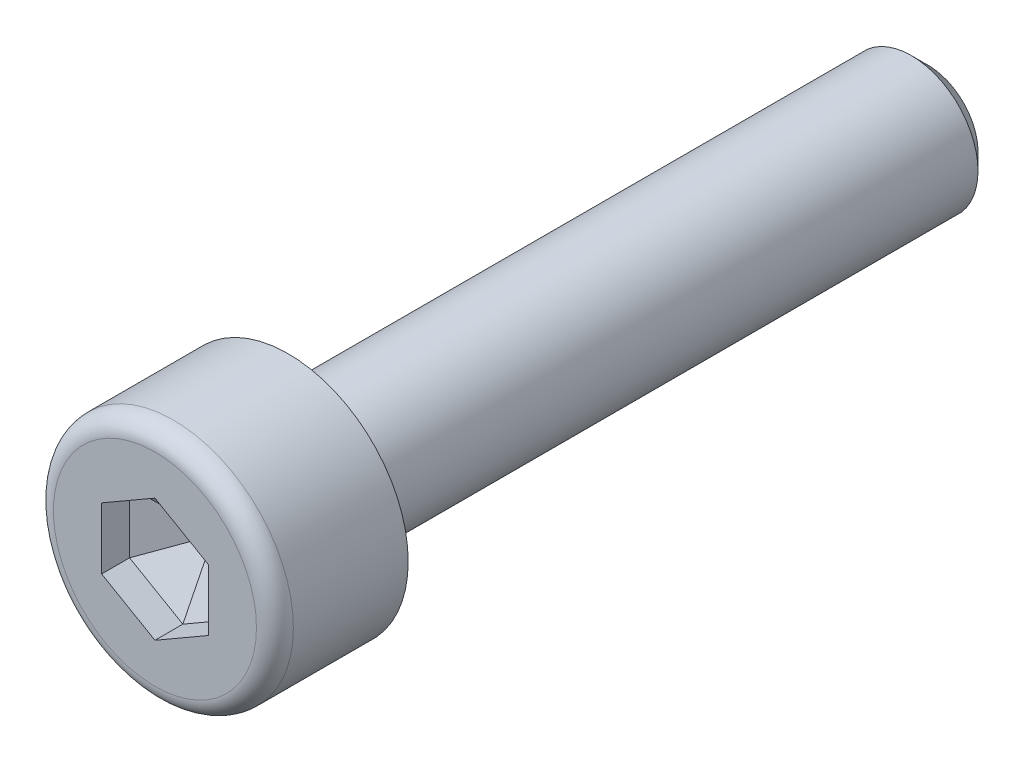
ISO-10303-21;
HEADER;
FILE_DESCRIPTION(('STEP AP214'),'2;1');
FILE_NAME('part.step','',(''),(''),'','','');
FILE_SCHEMA(('AUTOMOTIVE_DESIGN { 1 0 10303 214 1 1 1 1 }'));
ENDSEC;
DATA;
#1=APPLICATION_CONTEXT('core data for automotive mechanical design processes');
#2=APPLICATION_PROTOCOL_DEFINITION('international standard','automotive_design',2000,#1);
#3=PRODUCT_CONTEXT('',#1,'mechanical');
#4=PRODUCT('Part','Part','',(#3));
#5=PRODUCT_RELATED_PRODUCT_CATEGORY('part','',(#4));
#6=PRODUCT_DEFINITION_FORMATION('','',#4);
#7=PRODUCT_DEFINITION_CONTEXT('part definition',#1,'design');
#8=PRODUCT_DEFINITION('design','',#6,#7);
#9=PRODUCT_DEFINITION_SHAPE('','',#8);
#10=(LENGTH_UNIT() NAMED_UNIT(*) SI_UNIT(.MILLI.,.METRE.));
#11=(NAMED_UNIT(*) PLANE_ANGLE_UNIT() SI_UNIT($,.RADIAN.));
#12=(NAMED_UNIT(*) SI_UNIT($,.STERADIAN.) SOLID_ANGLE_UNIT());
#13=UNCERTAINTY_MEASURE_WITH_UNIT(LENGTH_MEASURE(1.E-05),#10,'distance_accuracy_value','');
#14=(GEOMETRIC_REPRESENTATION_CONTEXT(3) GLOBAL_UNCERTAINTY_ASSIGNED_CONTEXT((#13)) GLOBAL_UNIT_ASSIGNED_CONTEXT((#10,
#11,#12)) REPRESENTATION_CONTEXT('',''));
#15=CARTESIAN_POINT('',(0.,0.,0.));
#16=DIRECTION('',(0.,0.,1.));
#17=DIRECTION('',(1.,0.,0.));
#18=AXIS2_PLACEMENT_3D('',#15,#16,#17);
#19=CARTESIAN_POINT('',(0.,0.,0.));
#20=DIRECTION('',(0.,0.,1.));
#21=DIRECTION('',(1.,0.,0.));
#22=AXIS2_PLACEMENT_3D('',#19,#20,#21);
#23=PLANE('',#22);
#24=CARTESIAN_POINT('',(0.,0.,0.));
#25=DIRECTION('',(0.,0.,1.));
#26=DIRECTION('',(1.,0.,0.));
#27=AXIS2_PLACEMENT_3D('',#24,#25,#26);
#28=CIRCLE('',#27,1.35);
#29=CARTESIAN_POINT('',(1.35,0.,0.));
#30=VERTEX_POINT('',#29);
#31=EDGE_CURVE('E11',#30,#30,#28,.T.);
#32=ORIENTED_EDGE('',*,*,#31,.T.);
#33=EDGE_LOOP('',(#32));
#34=FACE_BOUND('',#33,.T.);
#35=CARTESIAN_POINT('',(0.,0.,0.));
#36=DIRECTION('',(0.,0.,1.));
#37=DIRECTION('',(1.,0.,0.));
#38=AXIS2_PLACEMENT_3D('',#35,#36,#37);
#39=CIRCLE('',#38,2.25);
#40=CARTESIAN_POINT('',(2.25,0.,0.));
#41=VERTEX_POINT('',#40);
#42=EDGE_CURVE('E160',#41,#41,#39,.T.);
#43=ORIENTED_EDGE('',*,*,#42,.F.);
#44=EDGE_LOOP('',(#43));
#45=FACE_BOUND('',#44,.T.);
#46=ADVANCED_FACE('F50',(#34,#45),#23,.F.);
#47=CARTESIAN_POINT('',(0.,0.,2.5));
#48=DIRECTION('',(0.,0.,-1.));
#49=DIRECTION('',(-1.,0.,0.));
#50=AXIS2_PLACEMENT_3D('',#47,#48,#49);
#51=CYLINDRICAL_SURFACE('',#50,2.25);
#52=CARTESIAN_POINT('',(0.,0.,2.15384615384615));
#53=DIRECTION('',(0.,0.,1.));
#54=DIRECTION('',(1.,0.,0.));
#55=AXIS2_PLACEMENT_3D('',#52,#53,#54);
#56=CIRCLE('',#55,2.25);
#57=CARTESIAN_POINT('',(2.25,0.,2.15384615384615));
#58=VERTEX_POINT('',#57);
#59=EDGE_CURVE('E178',#58,#58,#56,.F.);
#60=ORIENTED_EDGE('',*,*,#59,.T.);
#61=EDGE_LOOP('',(#60));
#62=FACE_BOUND('',#61,.T.);
#63=ORIENTED_EDGE('',*,*,#42,.T.);
#64=EDGE_LOOP('',(#63));
#65=FACE_BOUND('',#64,.T.);
#66=ADVANCED_FACE('F237',(#62,#65),#51,.T.);
#67=CARTESIAN_POINT('',(0.,0.,2.5));
#68=DIRECTION('',(0.,0.,1.));
#69=DIRECTION('',(1.,0.,0.));
#70=AXIS2_PLACEMENT_3D('',#67,#68,#69);
#71=PLANE('',#70);
#72=CARTESIAN_POINT('',(0.,0.,2.5));
#73=DIRECTION('',(0.,0.,1.));
#74=DIRECTION('',(1.,0.,0.));
#75=AXIS2_PLACEMENT_3D('',#72,#73,#74);
#76=CIRCLE('',#75,1.90384615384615);
#77=CARTESIAN_POINT('',(1.90384615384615,0.,2.5));
#78=VERTEX_POINT('',#77);
#79=EDGE_CURVE('E175',#78,#78,#76,.T.);
#80=ORIENTED_EDGE('',*,*,#79,.T.);
#81=EDGE_LOOP('',(#80));
#82=FACE_BOUND('',#81,.T.);
#83=DIRECTION('',(0.,1.,0.));
#84=VECTOR('',#83,1.);
#85=CARTESIAN_POINT('',(1.,-0.577350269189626,2.5));
#86=LINE('',#85,#84);
#87=CARTESIAN_POINT('',(1.,-0.577350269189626,2.5));
#88=VERTEX_POINT('',#87);
#89=CARTESIAN_POINT('',(1.,0.577350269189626,2.5));
#90=VERTEX_POINT('',#89);
#91=EDGE_CURVE('E142',#88,#90,#86,.T.);
#92=ORIENTED_EDGE('',*,*,#91,.F.);
#93=DIRECTION('',(0.866025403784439,0.5,0.));
#94=VECTOR('',#93,1.);
#95=CARTESIAN_POINT('',(0.,-1.15470053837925,2.5));
#96=LINE('',#95,#94);
#97=CARTESIAN_POINT('',(0.,-1.15470053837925,2.5));
#98=VERTEX_POINT('',#97);
#99=EDGE_CURVE('E155',#98,#88,#96,.T.);
#100=ORIENTED_EDGE('',*,*,#99,.F.);
#101=DIRECTION('',(0.866025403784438,-0.5,0.));
#102=VECTOR('',#101,1.);
#103=CARTESIAN_POINT('',(-1.,-0.577350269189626,2.5));
#104=LINE('',#103,#102);
#105=CARTESIAN_POINT('',(-1.,-0.577350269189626,2.5));
#106=VERTEX_POINT('',#105);
#107=EDGE_CURVE('E149',#106,#98,#104,.T.);
#108=ORIENTED_EDGE('',*,*,#107,.F.);
#109=DIRECTION('',(0.,-1.,0.));
#110=VECTOR('',#109,1.);
#111=CARTESIAN_POINT('',(-1.,0.577350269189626,2.5));
#112=LINE('',#111,#110);
#113=CARTESIAN_POINT('',(-1.,0.577350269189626,2.5));
#114=VERTEX_POINT('',#113);
#115=EDGE_CURVE('E147',#114,#106,#112,.T.);
#116=ORIENTED_EDGE('',*,*,#115,.F.);
#117=DIRECTION('',(-0.866025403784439,-0.5,0.));
#118=VECTOR('',#117,1.);
#119=CARTESIAN_POINT('',(0.,1.15470053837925,2.5));
#120=LINE('',#119,#118);
#121=CARTESIAN_POINT('',(0.,1.15470053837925,2.5));
#122=VERTEX_POINT('',#121);
#123=EDGE_CURVE('E127',#122,#114,#120,.T.);
#124=ORIENTED_EDGE('',*,*,#123,.F.);
#125=DIRECTION('',(-0.866025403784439,0.5,0.));
#126=VECTOR('',#125,1.);
#127=CARTESIAN_POINT('',(1.,0.577350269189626,2.5));
#128=LINE('',#127,#126);
#129=EDGE_CURVE('E137',#90,#122,#128,.T.);
#130=ORIENTED_EDGE('',*,*,#129,.F.);
#131=EDGE_LOOP('',(#92,#100,#108,#116,#124,#130));
#132=FACE_BOUND('',#131,.T.);
#133=ADVANCED_FACE('F144',(#82,#132),#71,.T.);
#134=CARTESIAN_POINT('',(1.,-0.577350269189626,1.4));
#135=DIRECTION('',(1.,0.,0.));
#136=DIRECTION('',(0.,0.,-1.));
#137=AXIS2_PLACEMENT_3D('',#134,#135,#136);
#138=PLANE('',#137);
#139=DIRECTION('',(0.,0.,1.));
#140=VECTOR('',#139,1.);
#141=CARTESIAN_POINT('',(1.,0.577350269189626,1.4));
#142=LINE('',#141,#140);
#143=CARTESIAN_POINT('',(1.,0.577350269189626,1.97636887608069));
#144=VERTEX_POINT('',#143);
#145=EDGE_CURVE('E134',#144,#90,#142,.T.);
#146=ORIENTED_EDGE('',*,*,#145,.F.);
#147=DIRECTION('',(0.,-1.,0.));
#148=VECTOR('',#147,1.);
#149=CARTESIAN_POINT('',(1.,-0.577350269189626,1.97636887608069));
#150=LINE('',#149,#148);
#151=CARTESIAN_POINT('',(1.,-0.577350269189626,1.97636887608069));
#152=VERTEX_POINT('',#151);
#153=EDGE_CURVE('E73',#144,#152,#150,.T.);
#154=ORIENTED_EDGE('',*,*,#153,.T.);
#155=DIRECTION('',(0.,0.,1.));
#156=VECTOR('',#155,1.);
#157=CARTESIAN_POINT('',(1.,-0.577350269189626,1.4));
#158=LINE('',#157,#156);
#159=EDGE_CURVE('E158',#152,#88,#158,.T.);
#160=ORIENTED_EDGE('',*,*,#159,.T.);
#161=ORIENTED_EDGE('',*,*,#91,.T.);
#162=EDGE_LOOP('',(#146,#154,#160,#161));
#163=FACE_BOUND('',#162,.T.);
#164=ADVANCED_FACE('F297',(#163),#138,.F.);
#165=CARTESIAN_POINT('',(0.,-1.15470053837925,1.4));
#166=DIRECTION('',(0.5,-0.866025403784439,0.));
#167=DIRECTION('',(0.866025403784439,0.5,0.));
#168=AXIS2_PLACEMENT_3D('',#165,#166,#167);
#169=PLANE('',#168);
#170=ORIENTED_EDGE('',*,*,#159,.F.);
#171=DIRECTION('',(-0.866025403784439,-0.5,0.));
#172=VECTOR('',#171,1.);
#173=CARTESIAN_POINT('',(0.,-1.15470053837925,1.97636887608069));
#174=LINE('',#173,#172);
#175=CARTESIAN_POINT('',(0.,-1.15470053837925,1.97636887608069));
#176=VERTEX_POINT('',#175);
#177=EDGE_CURVE('E65',#152,#176,#174,.T.);
#178=ORIENTED_EDGE('',*,*,#177,.T.);
#179=DIRECTION('',(0.,0.,1.));
#180=VECTOR('',#179,1.);
#181=CARTESIAN_POINT('',(0.,-1.15470053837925,1.4));
#182=LINE('',#181,#180);
#183=EDGE_CURVE('E161',#176,#98,#182,.T.);
#184=ORIENTED_EDGE('',*,*,#183,.T.);
#185=ORIENTED_EDGE('',*,*,#99,.T.);
#186=EDGE_LOOP('',(#170,#178,#184,#185));
#187=FACE_BOUND('',#186,.T.);
#188=ADVANCED_FACE('F299',(#187),#169,.F.);
#189=CARTESIAN_POINT('',(-1.,-0.577350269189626,1.4));
#190=DIRECTION('',(-0.5,-0.866025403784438,0.));
#191=DIRECTION('',(0.866025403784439,-0.5,0.));
#192=AXIS2_PLACEMENT_3D('',#189,#190,#191);
#193=PLANE('',#192);
#194=ORIENTED_EDGE('',*,*,#183,.F.);
#195=DIRECTION('',(-0.866025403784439,0.5,0.));
#196=VECTOR('',#195,1.);
#197=CARTESIAN_POINT('',(-1.,-0.577350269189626,1.97636887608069));
#198=LINE('',#197,#196);
#199=CARTESIAN_POINT('',(-1.,-0.577350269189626,1.97636887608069));
#200=VERTEX_POINT('',#199);
#201=EDGE_CURVE('E201',#176,#200,#198,.T.);
#202=ORIENTED_EDGE('',*,*,#201,.T.);
#203=DIRECTION('',(0.,0.,1.));
#204=VECTOR('',#203,1.);
#205=CARTESIAN_POINT('',(-1.,-0.577350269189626,1.4));
#206=LINE('',#205,#204);
#207=EDGE_CURVE('E163',#200,#106,#206,.T.);
#208=ORIENTED_EDGE('',*,*,#207,.T.);
#209=ORIENTED_EDGE('',*,*,#107,.T.);
#210=EDGE_LOOP('',(#194,#202,#208,#209));
#211=FACE_BOUND('',#210,.T.);
#212=ADVANCED_FACE('F288',(#211),#193,.F.);
#213=CARTESIAN_POINT('',(-1.,0.577350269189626,1.4));
#214=DIRECTION('',(-1.,0.,0.));
#215=DIRECTION('',(0.,0.,1.));
#216=AXIS2_PLACEMENT_3D('',#213,#214,#215);
#217=PLANE('',#216);
#218=ORIENTED_EDGE('',*,*,#207,.F.);
#219=DIRECTION('',(0.,1.,0.));
#220=VECTOR('',#219,1.);
#221=CARTESIAN_POINT('',(-1.,0.577350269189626,1.97636887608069));
#222=LINE('',#221,#220);
#223=CARTESIAN_POINT('',(-1.,0.577350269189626,1.97636887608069));
#224=VERTEX_POINT('',#223);
#225=EDGE_CURVE('E194',#200,#224,#222,.T.);
#226=ORIENTED_EDGE('',*,*,#225,.T.);
#227=DIRECTION('',(0.,0.,1.));
#228=VECTOR('',#227,1.);
#229=CARTESIAN_POINT('',(-1.,0.577350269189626,1.4));
#230=LINE('',#229,#228);
#231=EDGE_CURVE('E133',#224,#114,#230,.T.);
#232=ORIENTED_EDGE('',*,*,#231,.T.);
#233=ORIENTED_EDGE('',*,*,#115,.T.);
#234=EDGE_LOOP('',(#218,#226,#232,#233));
#235=FACE_BOUND('',#234,.T.);
#236=ADVANCED_FACE('F291',(#235),#217,.F.);
#237=CARTESIAN_POINT('',(0.,1.15470053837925,1.4));
#238=DIRECTION('',(-0.5,0.866025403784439,0.));
#239=DIRECTION('',(-0.866025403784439,-0.5,0.));
#240=AXIS2_PLACEMENT_3D('',#237,#238,#239);
#241=PLANE('',#240);
#242=ORIENTED_EDGE('',*,*,#231,.F.);
#243=DIRECTION('',(0.866025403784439,0.5,0.));
#244=VECTOR('',#243,1.);
#245=CARTESIAN_POINT('',(0.,1.15470053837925,1.97636887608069));
#246=LINE('',#245,#244);
#247=CARTESIAN_POINT('',(0.,1.15470053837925,1.97636887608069));
#248=VERTEX_POINT('',#247);
#249=EDGE_CURVE('E130',#224,#248,#246,.T.);
#250=ORIENTED_EDGE('',*,*,#249,.T.);
#251=DIRECTION('',(0.,0.,1.));
#252=VECTOR('',#251,1.);
#253=CARTESIAN_POINT('',(0.,1.15470053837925,1.4));
#254=LINE('',#253,#252);
#255=EDGE_CURVE('E122',#248,#122,#254,.T.);
#256=ORIENTED_EDGE('',*,*,#255,.T.);
#257=ORIENTED_EDGE('',*,*,#123,.T.);
#258=EDGE_LOOP('',(#242,#250,#256,#257));
#259=FACE_BOUND('',#258,.T.);
#260=ADVANCED_FACE('F125',(#259),#241,.F.);
#261=CARTESIAN_POINT('',(1.,0.577350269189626,1.4));
#262=DIRECTION('',(0.5,0.866025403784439,0.));
#263=DIRECTION('',(-0.866025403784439,0.5,0.));
#264=AXIS2_PLACEMENT_3D('',#261,#262,#263);
#265=PLANE('',#264);
#266=ORIENTED_EDGE('',*,*,#255,.F.);
#267=DIRECTION('',(0.866025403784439,-0.5,0.));
#268=VECTOR('',#267,1.);
#269=CARTESIAN_POINT('',(1.,0.577350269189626,1.97636887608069));
#270=LINE('',#269,#268);
#271=EDGE_CURVE('E198',#248,#144,#270,.T.);
#272=ORIENTED_EDGE('',*,*,#271,.T.);
#273=ORIENTED_EDGE('',*,*,#145,.T.);
#274=ORIENTED_EDGE('',*,*,#129,.T.);
#275=EDGE_LOOP('',(#266,#272,#273,#274));
#276=FACE_BOUND('',#275,.T.);
#277=ADVANCED_FACE('F138',(#276),#265,.F.);
#278=CARTESIAN_POINT('',(0.,0.,1.4));
#279=DIRECTION('',(0.,0.,1.));
#280=DIRECTION('',(1.,0.,0.));
#281=AXIS2_PLACEMENT_3D('',#278,#279,#280);
#282=PLANE('',#281);
#283=DIRECTION('',(-0.866025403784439,-0.5,0.));
#284=VECTOR('',#283,1.);
#285=CARTESIAN_POINT('',(-0.000849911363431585,0.00147208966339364,1.4));
#286=LINE('',#285,#284);
#287=CARTESIAN_POINT('',(0.,0.00196278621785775,1.4));
#288=VERTEX_POINT('',#287);
#289=CARTESIAN_POINT('',(-0.00169982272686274,0.000981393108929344,1.4));
#290=VERTEX_POINT('',#289);
#291=EDGE_CURVE('E189',#288,#290,#286,.T.);
#292=ORIENTED_EDGE('',*,*,#291,.T.);
#293=DIRECTION('',(0.,-1.,0.));
#294=VECTOR('',#293,1.);
#295=CARTESIAN_POINT('',(-0.00169982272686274,0.,1.4));
#296=LINE('',#295,#294);
#297=CARTESIAN_POINT('',(-0.00169982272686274,-0.000981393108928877,1.4));
#298=VERTEX_POINT('',#297);
#299=EDGE_CURVE('E191',#290,#298,#296,.T.);
#300=ORIENTED_EDGE('',*,*,#299,.T.);
#301=DIRECTION('',(0.866025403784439,-0.5,0.));
#302=VECTOR('',#301,1.);
#303=CARTESIAN_POINT('',(-0.000849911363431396,-0.00147208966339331,1.4));
#304=LINE('',#303,#302);
#305=CARTESIAN_POINT('',(0.,-0.00196278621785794,1.4));
#306=VERTEX_POINT('',#305);
#307=EDGE_CURVE('E183',#298,#306,#304,.T.);
#308=ORIENTED_EDGE('',*,*,#307,.T.);
#309=DIRECTION('',(0.866025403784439,0.5,0.));
#310=VECTOR('',#309,1.);
#311=CARTESIAN_POINT('',(0.000849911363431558,-0.0014720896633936,1.4));
#312=LINE('',#311,#310);
#313=CARTESIAN_POINT('',(0.00169982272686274,-0.000981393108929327,1.4));
#314=VERTEX_POINT('',#313);
#315=EDGE_CURVE('E181',#306,#314,#312,.T.);
#316=ORIENTED_EDGE('',*,*,#315,.T.);
#317=DIRECTION('',(0.,1.,0.));
#318=VECTOR('',#317,1.);
#319=CARTESIAN_POINT('',(0.00169982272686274,0.,1.4));
#320=LINE('',#319,#318);
#321=CARTESIAN_POINT('',(0.00169982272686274,0.000981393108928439,1.4));
#322=VERTEX_POINT('',#321);
#323=EDGE_CURVE('E185',#314,#322,#320,.T.);
#324=ORIENTED_EDGE('',*,*,#323,.T.);
#325=DIRECTION('',(-0.866025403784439,0.5,0.));
#326=VECTOR('',#325,1.);
#327=CARTESIAN_POINT('',(0.000849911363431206,0.00147208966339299,1.4));
#328=LINE('',#327,#326);
#329=EDGE_CURVE('E187',#322,#288,#328,.T.);
#330=ORIENTED_EDGE('',*,*,#329,.T.);
#331=EDGE_LOOP('',(#292,#300,#308,#316,#324,#330));
#332=FACE_BOUND('',#331,.T.);
#333=ADVANCED_FACE('F308',(#332),#282,.T.);
#334=CARTESIAN_POINT('',(0.,0.,-12.));
#335=DIRECTION('',(0.,0.,1.));
#336=DIRECTION('',(1.,0.,0.));
#337=AXIS2_PLACEMENT_3D('',#334,#335,#336);
#338=CYLINDRICAL_SURFACE('',#337,1.25);
#339=CARTESIAN_POINT('',(0.,0.,-0.0999999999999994));
#340=DIRECTION('',(0.,0.,1.));
#341=DIRECTION('',(1.,0.,0.));
#342=AXIS2_PLACEMENT_3D('',#339,#340,#341);
#343=CIRCLE('',#342,1.25);
#344=CARTESIAN_POINT('',(1.25,0.,-0.0999999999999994));
#345=VERTEX_POINT('',#344);
#346=EDGE_CURVE('E58',#345,#345,#343,.F.);
#347=ORIENTED_EDGE('',*,*,#346,.T.);
#348=EDGE_LOOP('',(#347));
#349=FACE_BOUND('',#348,.T.);
#350=CARTESIAN_POINT('',(0.,0.,-11.6875));
#351=DIRECTION('',(0.,0.,-1.));
#352=DIRECTION('',(-1.,0.,0.));
#353=AXIS2_PLACEMENT_3D('',#350,#351,#352);
#354=CIRCLE('',#353,1.25);
#355=CARTESIAN_POINT('',(-1.25,0.,-11.6875));
#356=VERTEX_POINT('',#355);
#357=EDGE_CURVE('E172',#356,#356,#354,.F.);
#358=ORIENTED_EDGE('',*,*,#357,.T.);
#359=EDGE_LOOP('',(#358));
#360=FACE_BOUND('',#359,.T.);
#361=ADVANCED_FACE('F222',(#349,#360),#338,.T.);
#362=CARTESIAN_POINT('',(0.,0.,-12.));
#363=DIRECTION('',(0.,0.,-1.));
#364=DIRECTION('',(-1.,0.,0.));
#365=AXIS2_PLACEMENT_3D('',#362,#363,#364);
#366=PLANE('',#365);
#367=CARTESIAN_POINT('',(0.,0.,-12.));
#368=DIRECTION('',(0.,0.,-1.));
#369=DIRECTION('',(-1.,0.,0.));
#370=AXIS2_PLACEMENT_3D('',#367,#368,#369);
#371=CIRCLE('',#370,0.937500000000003);
#372=CARTESIAN_POINT('',(-0.937500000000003,0.,-12.));
#373=VERTEX_POINT('',#372);
#374=EDGE_CURVE('E169',#373,#373,#371,.T.);
#375=ORIENTED_EDGE('',*,*,#374,.T.);
#376=EDGE_LOOP('',(#375));
#377=FACE_BOUND('',#376,.T.);
#378=ADVANCED_FACE('F253',(#377),#366,.T.);
#379=CARTESIAN_POINT('',(0.,0.,-12.));
#380=DIRECTION('',(0.,0.,1.));
#381=DIRECTION('',(1.,0.,0.));
#382=AXIS2_PLACEMENT_3D('',#379,#380,#381);
#383=CONICAL_SURFACE('',#382,0.937500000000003,0.785398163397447);
#384=ORIENTED_EDGE('',*,*,#357,.F.);
#385=EDGE_LOOP('',(#384));
#386=FACE_BOUND('',#385,.T.);
#387=ORIENTED_EDGE('',*,*,#374,.F.);
#388=EDGE_LOOP('',(#387));
#389=FACE_BOUND('',#388,.T.);
#390=ADVANCED_FACE('F249',(#386,#389),#383,.T.);
#391=CARTESIAN_POINT('',(0.,0.,2.15384615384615));
#392=DIRECTION('',(0.,0.,1.));
#393=DIRECTION('',(1.,0.,0.));
#394=AXIS2_PLACEMENT_3D('',#391,#392,#393);
#395=TOROIDAL_SURFACE('',#394,1.90384615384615,0.346153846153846);
#396=ORIENTED_EDGE('',*,*,#59,.F.);
#397=EDGE_LOOP('',(#396));
#398=FACE_BOUND('',#397,.T.);
#399=ORIENTED_EDGE('',*,*,#79,.F.);
#400=EDGE_LOOP('',(#399));
#401=FACE_BOUND('',#400,.T.);
#402=ADVANCED_FACE('F252',(#398,#401),#395,.T.);
#403=CARTESIAN_POINT('',(0.00169982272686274,0.,1.4));
#404=DIRECTION('',(0.499999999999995,0.,-0.866025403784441));
#405=DIRECTION('',(0.,1.,0.));
#406=AXIS2_PLACEMENT_3D('',#403,#404,#405);
#407=PLANE('',#406);
#408=DIRECTION('',(-0.774596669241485,0.447213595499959,-0.447213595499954));
#409=VECTOR('',#408,1.);
#410=CARTESIAN_POINT('',(0.00135985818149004,-0.000785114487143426,1.39980372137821));
#411=LINE('',#410,#409);
#412=EDGE_CURVE('E214',#152,#314,#411,.T.);
#413=ORIENTED_EDGE('',*,*,#412,.F.);
#414=ORIENTED_EDGE('',*,*,#153,.F.);
#415=DIRECTION('',(-0.774596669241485,-0.447213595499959,-0.447213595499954));
#416=VECTOR('',#415,1.);
#417=CARTESIAN_POINT('',(0.00135985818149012,0.000785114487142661,1.39980372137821));
#418=LINE('',#417,#416);
#419=EDGE_CURVE('E217',#322,#144,#418,.F.);
#420=ORIENTED_EDGE('',*,*,#419,.F.);
#421=ORIENTED_EDGE('',*,*,#323,.F.);
#422=EDGE_LOOP('',(#413,#414,#420,#421));
#423=FACE_BOUND('',#422,.T.);
#424=ADVANCED_FACE('F256',(#423),#407,.F.);
#425=CARTESIAN_POINT('',(0.000849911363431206,0.00147208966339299,1.4));
#426=DIRECTION('',(0.249999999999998,0.433012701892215,-0.866025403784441));
#427=DIRECTION('',(-0.866025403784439,0.5,0.));
#428=AXIS2_PLACEMENT_3D('',#425,#426,#427);
#429=PLANE('',#428);
#430=ORIENTED_EDGE('',*,*,#419,.T.);
#431=ORIENTED_EDGE('',*,*,#271,.F.);
#432=DIRECTION('',(0.,-0.894427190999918,-0.447213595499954));
#433=VECTOR('',#432,1.);
#434=CARTESIAN_POINT('',(0.,0.00157022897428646,1.39980372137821));
#435=LINE('',#434,#433);
#436=EDGE_CURVE('E211',#288,#248,#435,.F.);
#437=ORIENTED_EDGE('',*,*,#436,.F.);
#438=ORIENTED_EDGE('',*,*,#329,.F.);
#439=EDGE_LOOP('',(#430,#431,#437,#438));
#440=FACE_BOUND('',#439,.T.);
#441=ADVANCED_FACE('F269',(#440),#429,.F.);
#442=CARTESIAN_POINT('',(0.000849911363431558,-0.0014720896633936,1.4));
#443=DIRECTION('',(0.249999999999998,-0.433012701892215,-0.866025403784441));
#444=DIRECTION('',(0.866025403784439,0.5,0.));
#445=AXIS2_PLACEMENT_3D('',#442,#443,#444);
#446=PLANE('',#445);
#447=ORIENTED_EDGE('',*,*,#412,.T.);
#448=ORIENTED_EDGE('',*,*,#315,.F.);
#449=DIRECTION('',(0.,-0.894427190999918,0.447213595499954));
#450=VECTOR('',#449,1.);
#451=CARTESIAN_POINT('',(0.,-0.00157022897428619,1.39980372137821));
#452=LINE('',#451,#450);
#453=EDGE_CURVE('E208',#176,#306,#452,.F.);
#454=ORIENTED_EDGE('',*,*,#453,.F.);
#455=ORIENTED_EDGE('',*,*,#177,.F.);
#456=EDGE_LOOP('',(#447,#448,#454,#455));
#457=FACE_BOUND('',#456,.T.);
#458=ADVANCED_FACE('F265',(#457),#446,.F.);
#459=CARTESIAN_POINT('',(-0.000849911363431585,0.00147208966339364,1.4));
#460=DIRECTION('',(-0.249999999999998,0.433012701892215,-0.866025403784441));
#461=DIRECTION('',(-0.866025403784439,-0.5,0.));
#462=AXIS2_PLACEMENT_3D('',#459,#460,#461);
#463=PLANE('',#462);
#464=ORIENTED_EDGE('',*,*,#436,.T.);
#465=ORIENTED_EDGE('',*,*,#249,.F.);
#466=DIRECTION('',(0.774596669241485,-0.447213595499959,-0.447213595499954));
#467=VECTOR('',#466,1.);
#468=CARTESIAN_POINT('',(-0.00135985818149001,0.000785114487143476,1.39980372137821));
#469=LINE('',#468,#467);
#470=EDGE_CURVE('E206',#290,#224,#469,.F.);
#471=ORIENTED_EDGE('',*,*,#470,.F.);
#472=ORIENTED_EDGE('',*,*,#291,.F.);
#473=EDGE_LOOP('',(#464,#465,#471,#472));
#474=FACE_BOUND('',#473,.T.);
#475=ADVANCED_FACE('F261',(#474),#463,.F.);
#476=CARTESIAN_POINT('',(-0.000849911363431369,-0.00147208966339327,1.4));
#477=DIRECTION('',(-0.249999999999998,-0.433012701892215,-0.866025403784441));
#478=DIRECTION('',(0.866025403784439,-0.5,0.));
#479=AXIS2_PLACEMENT_3D('',#476,#477,#478);
#480=PLANE('',#479);
#481=ORIENTED_EDGE('',*,*,#453,.T.);
#482=ORIENTED_EDGE('',*,*,#307,.F.);
#483=DIRECTION('',(-0.774596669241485,-0.447213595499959,0.447213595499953));
#484=VECTOR('',#483,1.);
#485=CARTESIAN_POINT('',(-0.00135985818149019,-0.000785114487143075,1.39980372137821));
#486=LINE('',#485,#484);
#487=EDGE_CURVE('E204',#200,#298,#486,.F.);
#488=ORIENTED_EDGE('',*,*,#487,.F.);
#489=ORIENTED_EDGE('',*,*,#201,.F.);
#490=EDGE_LOOP('',(#481,#482,#488,#489));
#491=FACE_BOUND('',#490,.T.);
#492=ADVANCED_FACE('F232',(#491),#480,.F.);
#493=CARTESIAN_POINT('',(-0.00169982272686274,0.,1.4));
#494=DIRECTION('',(-0.499999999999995,0.,-0.866025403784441));
#495=DIRECTION('',(0.,-1.,0.));
#496=AXIS2_PLACEMENT_3D('',#493,#494,#495);
#497=PLANE('',#496);
#498=ORIENTED_EDGE('',*,*,#470,.T.);
#499=ORIENTED_EDGE('',*,*,#225,.F.);
#500=ORIENTED_EDGE('',*,*,#487,.T.);
#501=ORIENTED_EDGE('',*,*,#299,.F.);
#502=EDGE_LOOP('',(#498,#499,#500,#501));
#503=FACE_BOUND('',#502,.T.);
#504=ADVANCED_FACE('F226',(#503),#497,.F.);
#505=CARTESIAN_POINT('',(0.,0.,-0.0999999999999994));
#506=DIRECTION('',(0.,0.,1.));
#507=DIRECTION('',(1.,0.,0.));
#508=AXIS2_PLACEMENT_3D('',#505,#506,#507);
#509=TOROIDAL_SURFACE('',#508,1.35,0.1);
#510=ORIENTED_EDGE('',*,*,#31,.F.);
#511=EDGE_LOOP('',(#510));
#512=FACE_BOUND('',#511,.T.);
#513=ORIENTED_EDGE('',*,*,#346,.F.);
#514=EDGE_LOOP('',(#513));
#515=FACE_BOUND('',#514,.T.);
#516=ADVANCED_FACE('F52',(#512,#515),#509,.F.);
#517=CLOSED_SHELL('',(#46,#66,#133,#164,#188,#212,#236,#260,#277,#333,#361,#378,#390,#402,#424,
#441,#458,#475,#492,#504,#516));
#518=MANIFOLD_SOLID_BREP('B2',#517);
#519=ADVANCED_BREP_SHAPE_REPRESENTATION('',(#18,#518),#14);
#520=SHAPE_DEFINITION_REPRESENTATION(#9,#519);
ENDSEC;
END-ISO-10303-21;
